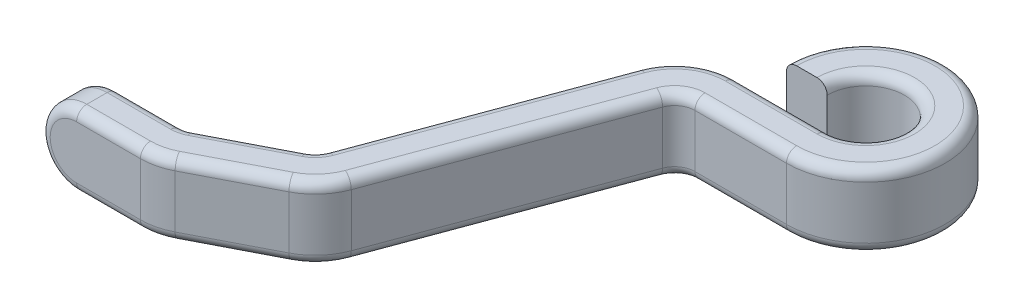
from build123d import *

# Parameters (mm, degrees)
BASE_EXTRUDE_DEPTH = 1
SKETCH3_W          = 1
SKETCH3_H          = 1.8
FILLET2_R          = 0.25
FILLET3_R          = 0.25


with BuildPart() as part:
    # Sketch1 → Base-Extrude (new body)
    with BuildSketch(Plane.XY):
        with BuildLine():
            Line((5.305323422, 0.9), (3.996041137, 0.9))
            ThreePointArc((3.996041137, 0.9), (3.096041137, 0), (3.996041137, -0.9))
            Line((3.996041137, -0.9), (5.305323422, -0.9))
            Line((5.305323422, -0.9), (5.305323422, 0.9))
        make_face()
    extrude(amount=BASE_EXTRUDE_DEPTH)

    # Boss-Sweep1: sweep along a path in Sketch2
    with BuildLine(Plane(origin=(0, 0, 0), x_dir=(1, 0, 0), z_dir=(0, 1, 0))) as boss_sweep1_path:
        Line((5.305323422, -0.5), (5.562500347, -0.5))
        ThreePointArc((5.562500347, -0.5), (5.798466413, -0.471761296), (6.021105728, -0.388640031))
        Line((6.021105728, -0.388640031), (7.866380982, 0.563661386))
        ThreePointArc((7.866380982, 0.563661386), (8.156658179, 0.789598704), (8.34560518, 1.105205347))
        Line((8.34560518, 1.105205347), (10.412481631, 6.689762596))
        ThreePointArc((10.412481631, 6.689762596), (10.778951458, 7.163366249), (11.350311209, 7.342666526))
        Line((11.350311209, 7.342666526), (13.600311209, 7.342666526))
        ThreePointArc((13.600311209, 7.342666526), (14.625616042, 9.817971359), (12.150311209, 8.792666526))
    # Sketch3 → Boss-Sweep1 (sweep)
    with BuildSketch(Plane(origin=(5.305323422, 0, 0), x_dir=(0, 0, -1), z_dir=(1, 0, 0))):
        with Locations((-0.5, 0)):
            Rectangle(SKETCH3_W, SKETCH3_H)
    sweep(path=boss_sweep1_path.line)

    # Fillet2
    fillet2_edges = [part.edges().sort_by_distance(p)[0] for p in [
        (4.779270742, 0.9, 1),
        (14.979169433, -0.9, -10.17152475),
        (12.475311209, -0.9, -6.842666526),
        (11.064631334, -0.9, -6.753016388),
        (9.847958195, -0.9, -3.723935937),
        (8.531099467, -0.9, -0.458247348),
        (7.173046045, -0.9, 0.356809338),
        (5.916449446, -0.9, 0.957641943),
        (5.916449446, 0.9, 0.957641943),
        (7.173046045, 0.9, 0.356809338),
        (8.531099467, 0.9, -0.458247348),
        (9.847958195, 0.9, -3.723935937),
        (11.064631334, 0.9, -6.753016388),
        (12.475311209, 0.9, -6.842666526),
        (14.979169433, 0.9, -10.17152475),
        (3.096041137, 0, 1),
        (4.779270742, -0.9, 1),
    ]]
    fillet(fillet2_edges, radius=FILLET2_R)

    # Fillet3
    fillet3_edges = [part.edges().sort_by_distance(p)[0] for p in [
        (14.272062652, 0.9, -9.464417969),
        (12.475311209, 0.9, -7.842666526),
        (10.493271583, 0.9, -7.57371611),
        (8.910128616, 0.9, -4.071032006),
        (7.78221689, 0.9, -1.120950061),
        (6.714440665, 0.9, -0.531830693),
        (5.68048338, 0.9, -0.014119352),
        (5.68048338, -0.9, -0.014119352),
        (6.714440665, -0.9, -0.531830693),
        (7.78221689, -0.9, -1.120950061),
        (8.910128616, -0.9, -4.071032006),
        (10.493271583, -0.9, -7.57371611),
        (12.475311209, -0.9, -7.842666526),
        (14.272062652, -0.9, -9.464417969),
        (4.779270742, 0.9, 0),
        (4.779270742, -0.9, 0),
        (3.096041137, 0, 0),
    ]]
    fillet(fillet3_edges, radius=FILLET3_R)


solid = part.part
